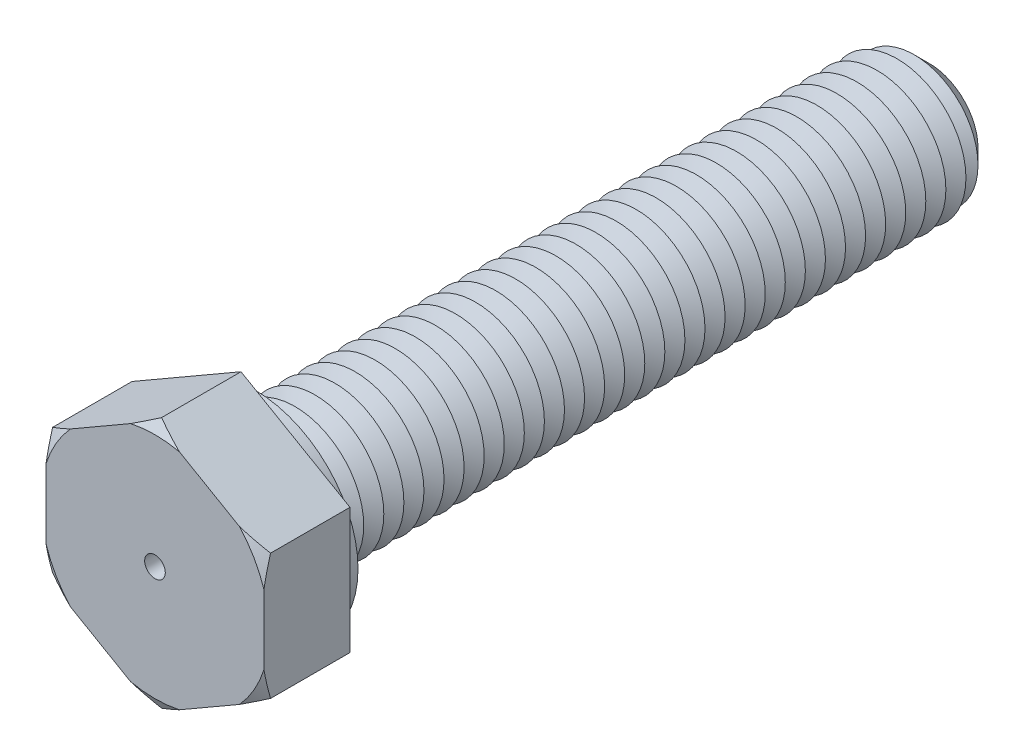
from build123d import *

# Parameters (mm, degrees)
BOSS_EXTRUDE1_DEPTH = 7.5
SKETCH3_R           = 6
BOSS_EXTRUDE2_DEPTH = 60
SKETCH4_R           = 9
BOSS_EXTRUDE3_DEPTH = 1.2
CHAMFER1_SIZE       = 1.75
LPATTERN1_COUNT     = 33
LPATTERN1_PITCH     = 1.75
SKETCH8_R           = 0.9
CUT_EXTRUDE1_DEPTH  = 67.5


with BuildPart() as part:
    # Sketch2 → Boss-Extrude1 (new body)
    with BuildSketch(Plane.XY):
        Polygon((0, 10.969655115), (-9.5, 5.484827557), (-9.5, -5.484827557), (0, -10.969655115), (9.5, -5.484827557), (9.5, 5.484827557), align=None)
    extrude(amount=BOSS_EXTRUDE1_DEPTH)

    # Sketch3 → Boss-Extrude2 (add)
    with BuildSketch(Plane(origin=(0, 0, 0), x_dir=(-1, 0, 0), z_dir=(0, 0, -1))):
        Circle(SKETCH3_R)
    extrude(amount=BOSS_EXTRUDE2_DEPTH)

    # Sketch4 → Boss-Extrude3 (add)
    with BuildSketch(Plane(origin=(0, 0, 0), x_dir=(-1, 0, 0), z_dir=(0, 0, -1))):
        with Locations(Location((0, 0, 0), (0, 0, 180))):
            Circle(SKETCH4_R)
    extrude(amount=BOSS_EXTRUDE3_DEPTH)

    # Chamfer1
    chamfer1_edges = [part.edges().sort_by_distance(p)[0] for p in [
        (6, 0, -60),
    ]]
    chamfer(chamfer1_edges, length=CHAMFER1_SIZE)

    # Sketch6 → Cut-Revolve1 (revolve, cut)
    with BuildSketch(Plane(origin=(0, 0, 0), x_dir=(0, 0, -1), z_dir=(1, 0, 0)), mode=Mode.PRIVATE) as cut_revolve1_sk:
        Polygon((1.2, 6), (2.075, 4.484455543), (2.95, 6), align=None)
    cut_revolve1 = revolve(cut_revolve1_sk.sketch.rotate(Axis((0, 0, 3.211670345), (0, 0, -1)), 90), axis=Axis((0, 0, 3.211670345), (0, 0, -1)), mode=Mode.SUBTRACT)

    # LPattern1: Cut-Revolve1 ×33
    with Locations(*[(0, 0, -i * LPATTERN1_PITCH) for i in range(1, LPATTERN1_COUNT)]):
        add(cut_revolve1, mode=Mode.SUBTRACT)

    # Sketch7 → Cut-Revolve2 (revolve, cut)
    with BuildSketch(Plane(origin=(0, 0, 0), x_dir=(0, 0, -1), z_dir=(1, 0, 0)), mode=Mode.PRIVATE) as cut_revolve2_sk:
        Polygon((-7.5, 10.969655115), (-7.5, 9.969655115), (-6.922649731, 10.969655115), align=None)
    revolve(cut_revolve2_sk.sketch.rotate(Axis((0, 0, 3.211670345), (0, 0, -1)), 90), axis=Axis((0, 0, 3.211670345), (0, 0, -1)), mode=Mode.SUBTRACT)

    # Sketch8 → Cut-Extrude1 (cut)
    with BuildSketch(Plane.XY.offset(7.5)):
        Circle(SKETCH8_R)
    extrude(amount=-CUT_EXTRUDE1_DEPTH, mode=Mode.SUBTRACT)


solid = part.part
